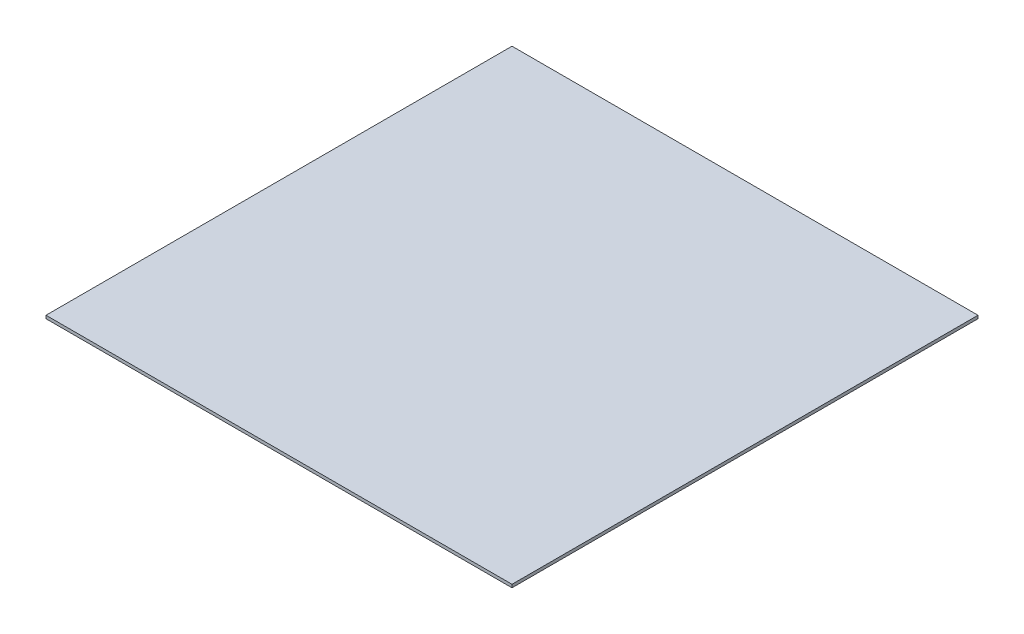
ISO-10303-21;
HEADER;
FILE_DESCRIPTION(('STEP AP214'),'2;1');
FILE_NAME('part.step','',(''),(''),'','','');
FILE_SCHEMA(('AUTOMOTIVE_DESIGN { 1 0 10303 214 1 1 1 1 }'));
ENDSEC;
DATA;
#1=APPLICATION_CONTEXT('core data for automotive mechanical design processes');
#2=APPLICATION_PROTOCOL_DEFINITION('international standard','automotive_design',2000,#1);
#3=PRODUCT_CONTEXT('',#1,'mechanical');
#4=PRODUCT('Part','Part','',(#3));
#5=PRODUCT_RELATED_PRODUCT_CATEGORY('part','',(#4));
#6=PRODUCT_DEFINITION_FORMATION('','',#4);
#7=PRODUCT_DEFINITION_CONTEXT('part definition',#1,'design');
#8=PRODUCT_DEFINITION('design','',#6,#7);
#9=PRODUCT_DEFINITION_SHAPE('','',#8);
#10=(LENGTH_UNIT() NAMED_UNIT(*) SI_UNIT(.MILLI.,.METRE.));
#11=(NAMED_UNIT(*) PLANE_ANGLE_UNIT() SI_UNIT($,.RADIAN.));
#12=(NAMED_UNIT(*) SI_UNIT($,.STERADIAN.) SOLID_ANGLE_UNIT());
#13=UNCERTAINTY_MEASURE_WITH_UNIT(LENGTH_MEASURE(1.E-05),#10,'distance_accuracy_value','');
#14=(GEOMETRIC_REPRESENTATION_CONTEXT(3) GLOBAL_UNCERTAINTY_ASSIGNED_CONTEXT((#13)) GLOBAL_UNIT_ASSIGNED_CONTEXT((#10,
#11,#12)) REPRESENTATION_CONTEXT('',''));
#15=CARTESIAN_POINT('',(0.,0.,0.));
#16=DIRECTION('',(0.,0.,1.));
#17=DIRECTION('',(1.,0.,0.));
#18=AXIS2_PLACEMENT_3D('',#15,#16,#17);
#19=CARTESIAN_POINT('',(304.8,4.,304.8));
#20=DIRECTION('',(-1.,0.,0.));
#21=DIRECTION('',(0.,0.,1.));
#22=AXIS2_PLACEMENT_3D('',#19,#20,#21);
#23=PLANE('',#22);
#24=DIRECTION('',(0.,0.,-1.));
#25=VECTOR('',#24,1.);
#26=CARTESIAN_POINT('',(304.8,0.,304.8));
#27=LINE('',#26,#25);
#28=CARTESIAN_POINT('',(304.8,0.,304.8));
#29=VERTEX_POINT('',#28);
#30=CARTESIAN_POINT('',(304.8,0.,-304.8));
#31=VERTEX_POINT('',#30);
#32=EDGE_CURVE('E115',#29,#31,#27,.T.);
#33=ORIENTED_EDGE('',*,*,#32,.T.);
#34=DIRECTION('',(0.,-1.,0.));
#35=VECTOR('',#34,1.);
#36=CARTESIAN_POINT('',(304.8,4.,-304.8));
#37=LINE('',#36,#35);
#38=CARTESIAN_POINT('',(304.8,4.,-304.8));
#39=VERTEX_POINT('',#38);
#40=EDGE_CURVE('E11',#39,#31,#37,.T.);
#41=ORIENTED_EDGE('',*,*,#40,.F.);
#42=DIRECTION('',(0.,0.,-1.));
#43=VECTOR('',#42,1.);
#44=CARTESIAN_POINT('',(304.8,4.,304.8));
#45=LINE('',#44,#43);
#46=CARTESIAN_POINT('',(304.8,4.,304.8));
#47=VERTEX_POINT('',#46);
#48=EDGE_CURVE('E99',#47,#39,#45,.T.);
#49=ORIENTED_EDGE('',*,*,#48,.F.);
#50=DIRECTION('',(0.,-1.,0.));
#51=VECTOR('',#50,1.);
#52=CARTESIAN_POINT('',(304.8,4.,304.8));
#53=LINE('',#52,#51);
#54=EDGE_CURVE('E111',#47,#29,#53,.T.);
#55=ORIENTED_EDGE('',*,*,#54,.T.);
#56=EDGE_LOOP('',(#33,#41,#49,#55));
#57=FACE_BOUND('',#56,.T.);
#58=ADVANCED_FACE('F47',(#57),#23,.F.);
#59=CARTESIAN_POINT('',(-304.8,4.,-304.8));
#60=DIRECTION('',(0.,0.,1.));
#61=DIRECTION('',(1.,0.,0.));
#62=AXIS2_PLACEMENT_3D('',#59,#60,#61);
#63=PLANE('',#62);
#64=DIRECTION('',(-1.,0.,0.));
#65=VECTOR('',#64,1.);
#66=CARTESIAN_POINT('',(-304.8,0.,-304.8));
#67=LINE('',#66,#65);
#68=CARTESIAN_POINT('',(-304.8,0.,-304.8));
#69=VERTEX_POINT('',#68);
#70=EDGE_CURVE('E104',#31,#69,#67,.T.);
#71=ORIENTED_EDGE('',*,*,#70,.T.);
#72=DIRECTION('',(0.,-1.,0.));
#73=VECTOR('',#72,1.);
#74=CARTESIAN_POINT('',(-304.8,4.,-304.8));
#75=LINE('',#74,#73);
#76=CARTESIAN_POINT('',(-304.8,4.,-304.8));
#77=VERTEX_POINT('',#76);
#78=EDGE_CURVE('E56',#77,#69,#75,.T.);
#79=ORIENTED_EDGE('',*,*,#78,.F.);
#80=DIRECTION('',(-1.,0.,0.));
#81=VECTOR('',#80,1.);
#82=CARTESIAN_POINT('',(-304.8,4.,-304.8));
#83=LINE('',#82,#81);
#84=EDGE_CURVE('E94',#39,#77,#83,.T.);
#85=ORIENTED_EDGE('',*,*,#84,.F.);
#86=ORIENTED_EDGE('',*,*,#40,.T.);
#87=EDGE_LOOP('',(#71,#79,#85,#86));
#88=FACE_BOUND('',#87,.T.);
#89=ADVANCED_FACE('F103',(#88),#63,.F.);
#90=CARTESIAN_POINT('',(-304.8,4.,304.8));
#91=DIRECTION('',(1.,0.,0.));
#92=DIRECTION('',(0.,0.,-1.));
#93=AXIS2_PLACEMENT_3D('',#90,#91,#92);
#94=PLANE('',#93);
#95=DIRECTION('',(0.,0.,1.));
#96=VECTOR('',#95,1.);
#97=CARTESIAN_POINT('',(-304.8,0.,304.8));
#98=LINE('',#97,#96);
#99=CARTESIAN_POINT('',(-304.8,0.,304.8));
#100=VERTEX_POINT('',#99);
#101=EDGE_CURVE('E81',#69,#100,#98,.T.);
#102=ORIENTED_EDGE('',*,*,#101,.T.);
#103=DIRECTION('',(0.,-1.,0.));
#104=VECTOR('',#103,1.);
#105=CARTESIAN_POINT('',(-304.8,4.,304.8));
#106=LINE('',#105,#104);
#107=CARTESIAN_POINT('',(-304.8,4.,304.8));
#108=VERTEX_POINT('',#107);
#109=EDGE_CURVE('E106',#108,#100,#106,.T.);
#110=ORIENTED_EDGE('',*,*,#109,.F.);
#111=DIRECTION('',(0.,0.,1.));
#112=VECTOR('',#111,1.);
#113=CARTESIAN_POINT('',(-304.8,4.,304.8));
#114=LINE('',#113,#112);
#115=EDGE_CURVE('E97',#77,#108,#114,.T.);
#116=ORIENTED_EDGE('',*,*,#115,.F.);
#117=ORIENTED_EDGE('',*,*,#78,.T.);
#118=EDGE_LOOP('',(#102,#110,#116,#117));
#119=FACE_BOUND('',#118,.T.);
#120=ADVANCED_FACE('F107',(#119),#94,.F.);
#121=CARTESIAN_POINT('',(-304.8,4.,304.8));
#122=DIRECTION('',(0.,0.,-1.));
#123=DIRECTION('',(-1.,0.,0.));
#124=AXIS2_PLACEMENT_3D('',#121,#122,#123);
#125=PLANE('',#124);
#126=DIRECTION('',(1.,0.,0.));
#127=VECTOR('',#126,1.);
#128=CARTESIAN_POINT('',(-304.8,0.,304.8));
#129=LINE('',#128,#127);
#130=EDGE_CURVE('E87',#100,#29,#129,.T.);
#131=ORIENTED_EDGE('',*,*,#130,.T.);
#132=ORIENTED_EDGE('',*,*,#54,.F.);
#133=DIRECTION('',(1.,0.,0.));
#134=VECTOR('',#133,1.);
#135=CARTESIAN_POINT('',(-304.8,4.,304.8));
#136=LINE('',#135,#134);
#137=EDGE_CURVE('E64',#108,#47,#136,.T.);
#138=ORIENTED_EDGE('',*,*,#137,.F.);
#139=ORIENTED_EDGE('',*,*,#109,.T.);
#140=EDGE_LOOP('',(#131,#132,#138,#139));
#141=FACE_BOUND('',#140,.T.);
#142=ADVANCED_FACE('F128',(#141),#125,.F.);
#143=CARTESIAN_POINT('',(0.,4.,0.));
#144=DIRECTION('',(0.,-1.,0.));
#145=DIRECTION('',(0.,0.,-1.));
#146=AXIS2_PLACEMENT_3D('',#143,#144,#145);
#147=PLANE('',#146);
#148=ORIENTED_EDGE('',*,*,#48,.T.);
#149=ORIENTED_EDGE('',*,*,#84,.T.);
#150=ORIENTED_EDGE('',*,*,#115,.T.);
#151=ORIENTED_EDGE('',*,*,#137,.T.);
#152=EDGE_LOOP('',(#148,#149,#150,#151));
#153=FACE_BOUND('',#152,.T.);
#154=ADVANCED_FACE('F95',(#153),#147,.F.);
#155=CARTESIAN_POINT('',(0.,0.,0.));
#156=DIRECTION('',(0.,-1.,0.));
#157=DIRECTION('',(0.,0.,-1.));
#158=AXIS2_PLACEMENT_3D('',#155,#156,#157);
#159=PLANE('',#158);
#160=ORIENTED_EDGE('',*,*,#32,.F.);
#161=ORIENTED_EDGE('',*,*,#130,.F.);
#162=ORIENTED_EDGE('',*,*,#101,.F.);
#163=ORIENTED_EDGE('',*,*,#70,.F.);
#164=EDGE_LOOP('',(#160,#161,#162,#163));
#165=FACE_BOUND('',#164,.T.);
#166=ADVANCED_FACE('F131',(#165),#159,.T.);
#167=CLOSED_SHELL('',(#58,#89,#120,#142,#154,#166));
#168=MANIFOLD_SOLID_BREP('B2',#167);
#169=ADVANCED_BREP_SHAPE_REPRESENTATION('',(#18,#168),#14);
#170=SHAPE_DEFINITION_REPRESENTATION(#9,#169);
ENDSEC;
END-ISO-10303-21;
